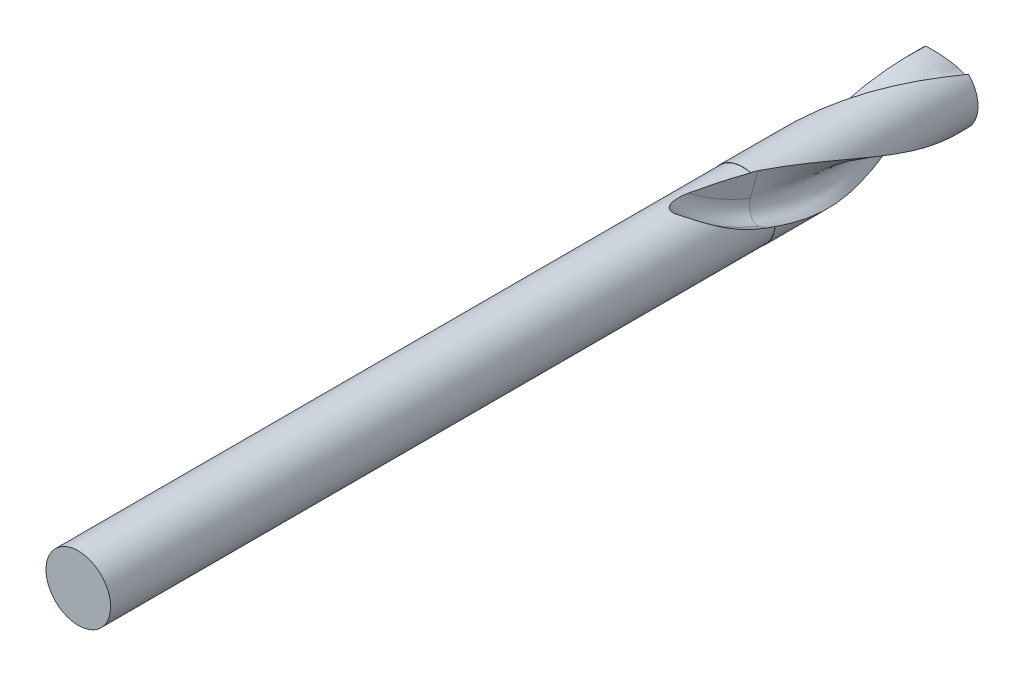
from build123d import *

# Parameters (mm, degrees)
FOPO_DENT_PITCH       = 8.63
FOPO_DENT_HEIGHT      = 3.9
FOPO_DENT_RADIUS      = 0.5
FOPO_DENT_START_ANGLE = 135
FOPO_DEG_ANGLE        = 90
REP_COUNT             = 2


with BuildPart() as part:
    # EsqCorps → CorpsOutil (revolve)
    with BuildSketch(Plane(origin=(0, 0, 0), x_dir=(0, 0, -1), z_dir=(1, 0, 0)), mode=Mode.PRIVATE) as corpsoutil_sk:
        Polygon((0, 0), (-13.6, 0), (-13.6, 0.496), (-3.4, 0.496), (-3.4, 0.5), (-0.288675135, 0.5), align=None)
    revolve(corpsoutil_sk.sketch.rotate(Axis((0, 0, 0.300640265), (0, 0, -1)), 180), axis=Axis((0, 0, 0.300640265), (0, 0, -1)))

    # FOPO-Dent: sweep along a helix
    with BuildLine() as fopo_dent_path:
        add(Helix(FOPO_DENT_PITCH, FOPO_DENT_HEIGHT, FOPO_DENT_RADIUS, center=(0, 0, 3.4), direction=(0, 0, -1), mode=Mode.PRIVATE).rotate(Axis((0, 0, 3.4), (0, 0, -1)), FOPO_DENT_START_ANGLE))
    # EsqDent → FOPO-Dent (sweep, cut)
    with BuildSketch(Plane(origin=(0.353553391, 0.353553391, 3.4), x_dir=(-0.9656323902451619, 0.034929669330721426, -0.257553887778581), z_dir=(0.24188076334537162, -0.24188076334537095, -0.9396740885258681))):
        with BuildLine():
            Line((0.229053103, -0.236570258), (0.229053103, 0.618524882))
            ThreePointArc((0.229053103, 0.618524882), (-0.328822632, 0.37666394), (-0.643467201, -0.143644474))
            Line((-0.643467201, -0.143644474), (-0.05547055, -0.417831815))
            ThreePointArc((-0.05547055, -0.417831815), (0.136513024, -0.405248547), (0.229053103, -0.236570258))
        make_face()
    fopo_dent = sweep(path=fopo_dent_path.line, is_frenet=True, mode=Mode.SUBTRACT)

    # EsqDeg → FOPO-Deg (revolve, cut)
    with BuildSketch(Plane(origin=(0.353553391, 0.353553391, 3.4), x_dir=(-0.9656323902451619, 0.034929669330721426, -0.257553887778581), z_dir=(0.24188076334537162, -0.24188076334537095, -0.9396740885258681))):
        with BuildLine():
            Line((0.229053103, -0.236570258), (0.229053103, 0.618524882))
            ThreePointArc((0.229053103, 0.618524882), (-0.328822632, 0.37666394), (-0.643467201, -0.143644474))
            Line((-0.643467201, -0.143644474), (-0.05547055, -0.417831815))
            ThreePointArc((-0.05547055, -0.417831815), (0.136513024, -0.405248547), (0.229053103, -0.236570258))
        make_face()
    fopo_deg = revolve(axis=Axis((1.696882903, 2.371413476, 3.226369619), (-0.9656323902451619, 0.03492966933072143, -0.257553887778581)), revolution_arc=FOPO_DEG_ANGLE, mode=Mode.SUBTRACT)

    # Rep: FOPO-Dent, FOPO-Deg ×2 about axis
    rep_axis = Axis((0, 0, -1.449807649), (0, 0, 1))
    add([fopo_dent.rotate(rep_axis, i * 360 / REP_COUNT) for i in range(1, REP_COUNT)], mode=Mode.SUBTRACT)
    add([fopo_deg.rotate(rep_axis, i * 360 / REP_COUNT) for i in range(1, REP_COUNT)], mode=Mode.SUBTRACT)


solid = part.part
